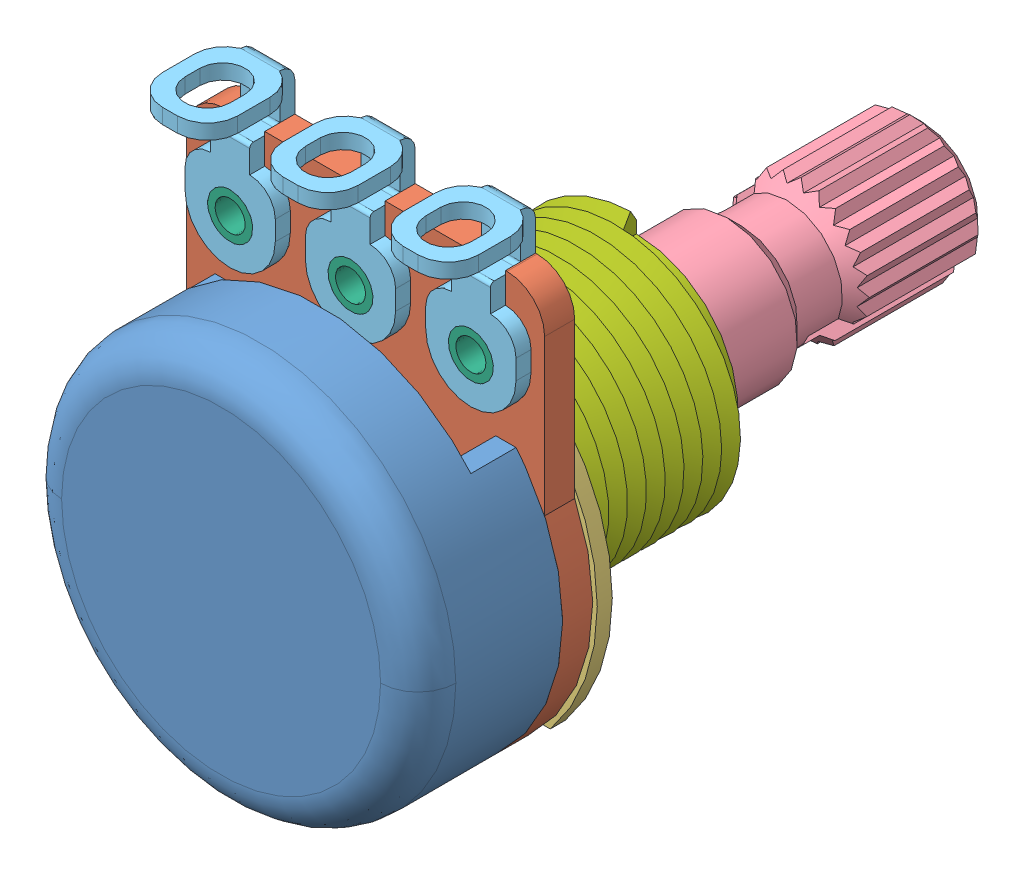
SolidWorks assembly Single_Pot.sldasm, configuration Valor predeterminado (file format 5000). Lengths in mm.
Overall size (17.02 21.84 29.59).
11 component instances, 7 part files, 0 mates.
Components (placement in the parent):
- Body-1: Body.sldprt [Valor predeterminado<Como usinado>] at origin size (16.64 16.64 6.1)
- PCB-1: PCB.sldprt [Valor predeterminado<Como usinado>] at (0 0 -1.27) size (16.64 19.94 1.27)
- Plate-1: Plate.sldprt [Valor predeterminado<Como usinado>] at (0 0 -1.905) size (17.02 10.92 0.64)
- Shaft-1: Shaft.sldprt [Valor predeterminado<Como usinado>] at (0 0 -1.905) x (-0.6188 -0.785548 0) z (0 0 -1) size (5.97 5.97 21.59)
- Wire_Tab-1: Wire_Tab.sldprt [Valor predeterminado<Como usinado>] at (-3.175 6.5405 0) x (0 1 0) z (0 0 1) size (6.98 3.81 4.44)
- Wire_Tab-2: Wire_Tab.sldprt [Valor predeterminado<Como usinado>] at (1.905 6.5405 0) x (0 1 0) z (0 0 1) size (6.98 3.81 4.44)
- Wire_Tab-3: Wire_Tab.sldprt [Valor predeterminado<Como usinado>] at (6.985 6.5405 0) x (0 1 0) z (0 0 1) size (6.98 3.81 4.44)
- Rivet-1: Rivet.sldprt [Valor predeterminado<Como usinado>] at (-5.08 8.4455 0.635) x (-0.923728 -0.383049 0) z (0 0 -1) size (2.54 2.54 2.22)
- Rivet-2: Rivet.sldprt [Valor predeterminado<Como usinado>] at (0 8.4455 0.635) x (-0.923728 -0.383049 0) z (0 0 -1) size (2.54 2.54 2.22)
- Rivet-3: Rivet.sldprt [Valor predeterminado<Como usinado>] at (5.08 8.4455 0.635) x (-0.923728 -0.383049 0) z (0 0 -1) size (2.54 2.54 2.22)
- Barrell2-1: Barrell2.sldprt [Valor predeterminado<Como usinado>] at (0 0 -11.43) size (10.47 10.47 9.77)
